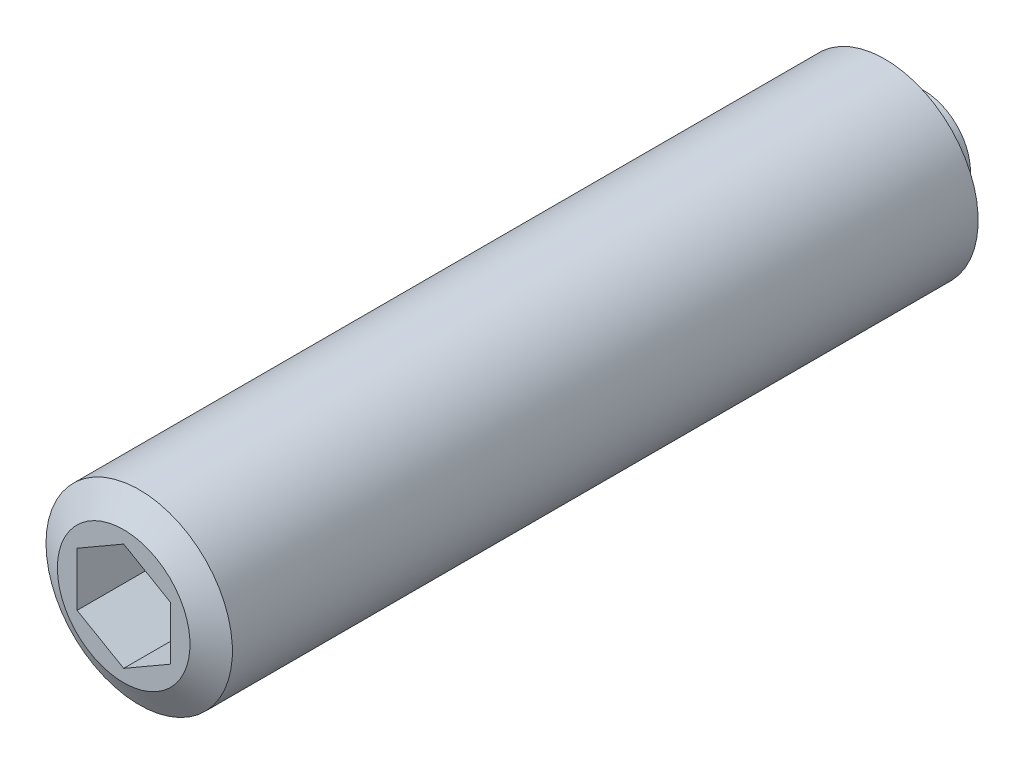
ISO-10303-21;
HEADER;
FILE_DESCRIPTION(('STEP AP214'),'2;1');
FILE_NAME('part.step','',(''),(''),'','','');
FILE_SCHEMA(('AUTOMOTIVE_DESIGN { 1 0 10303 214 1 1 1 1 }'));
ENDSEC;
DATA;
#1=APPLICATION_CONTEXT('core data for automotive mechanical design processes');
#2=APPLICATION_PROTOCOL_DEFINITION('international standard','automotive_design',2000,#1);
#3=PRODUCT_CONTEXT('',#1,'mechanical');
#4=PRODUCT('Part','Part','',(#3));
#5=PRODUCT_RELATED_PRODUCT_CATEGORY('part','',(#4));
#6=PRODUCT_DEFINITION_FORMATION('','',#4);
#7=PRODUCT_DEFINITION_CONTEXT('part definition',#1,'design');
#8=PRODUCT_DEFINITION('design','',#6,#7);
#9=PRODUCT_DEFINITION_SHAPE('','',#8);
#10=(LENGTH_UNIT() NAMED_UNIT(*) SI_UNIT(.MILLI.,.METRE.));
#11=(NAMED_UNIT(*) PLANE_ANGLE_UNIT() SI_UNIT($,.RADIAN.));
#12=(NAMED_UNIT(*) SI_UNIT($,.STERADIAN.) SOLID_ANGLE_UNIT());
#13=UNCERTAINTY_MEASURE_WITH_UNIT(LENGTH_MEASURE(1.E-05),#10,'distance_accuracy_value','');
#14=(GEOMETRIC_REPRESENTATION_CONTEXT(3) GLOBAL_UNCERTAINTY_ASSIGNED_CONTEXT((#13)) GLOBAL_UNIT_ASSIGNED_CONTEXT((#10,
#11,#12)) REPRESENTATION_CONTEXT('',''));
#15=CARTESIAN_POINT('',(0.,0.,0.));
#16=DIRECTION('',(0.,0.,1.));
#17=DIRECTION('',(1.,0.,0.));
#18=AXIS2_PLACEMENT_3D('',#15,#16,#17);
#19=CARTESIAN_POINT('',(0.,0.,0.));
#20=DIRECTION('',(0.,0.,-1.));
#21=DIRECTION('',(-1.,0.,0.));
#22=AXIS2_PLACEMENT_3D('',#19,#20,#21);
#23=PLANE('',#22);
#24=CARTESIAN_POINT('',(0.,0.,0.));
#25=DIRECTION('',(0.,0.,-1.));
#26=DIRECTION('',(-1.,0.,0.));
#27=AXIS2_PLACEMENT_3D('',#24,#25,#26);
#28=CIRCLE('',#27,3.);
#29=CARTESIAN_POINT('',(-3.,0.,0.));
#30=VERTEX_POINT('',#29);
#31=EDGE_CURVE('E9',#30,#30,#28,.T.);
#32=ORIENTED_EDGE('',*,*,#31,.T.);
#33=EDGE_LOOP('',(#32));
#34=FACE_BOUND('',#33,.T.);
#35=ADVANCED_FACE('F14',(#34),#23,.T.);
#36=CARTESIAN_POINT('',(0.,0.,-2.));
#37=DIRECTION('',(0.,0.,-1.));
#38=DIRECTION('',(-1.,0.,0.));
#39=AXIS2_PLACEMENT_3D('',#36,#37,#38);
#40=CYLINDRICAL_SURFACE('',#39,3.);
#41=CARTESIAN_POINT('',(0.,0.,1.5));
#42=DIRECTION('',(0.,0.,-1.));
#43=DIRECTION('',(-1.,0.,0.));
#44=AXIS2_PLACEMENT_3D('',#41,#42,#43);
#45=CIRCLE('',#44,3.);
#46=CARTESIAN_POINT('',(-3.,0.,1.5));
#47=VERTEX_POINT('',#46);
#48=EDGE_CURVE('E21',#47,#47,#45,.T.);
#49=ORIENTED_EDGE('',*,*,#48,.T.);
#50=EDGE_LOOP('',(#49));
#51=FACE_BOUND('',#50,.T.);
#52=ORIENTED_EDGE('',*,*,#31,.F.);
#53=EDGE_LOOP('',(#52));
#54=FACE_BOUND('',#53,.T.);
#55=ADVANCED_FACE('F134',(#51,#54),#40,.T.);
#56=CARTESIAN_POINT('',(0.,3.,1.5));
#57=DIRECTION('',(0.,0.,-1.));
#58=DIRECTION('',(-1.,0.,0.));
#59=AXIS2_PLACEMENT_3D('',#56,#57,#58);
#60=PLANE('',#59);
#61=CARTESIAN_POINT('',(0.,0.,1.5));
#62=DIRECTION('',(0.,0.,-1.));
#63=DIRECTION('',(-1.,0.,0.));
#64=AXIS2_PLACEMENT_3D('',#61,#62,#63);
#65=CIRCLE('',#64,4.267949);
#66=CARTESIAN_POINT('',(-4.267949,0.,1.5));
#67=VERTEX_POINT('',#66);
#68=EDGE_CURVE('E129',#67,#67,#65,.T.);
#69=ORIENTED_EDGE('',*,*,#68,.T.);
#70=EDGE_LOOP('',(#69));
#71=FACE_BOUND('',#70,.T.);
#72=ORIENTED_EDGE('',*,*,#48,.F.);
#73=EDGE_LOOP('',(#72));
#74=FACE_BOUND('',#73,.T.);
#75=ADVANCED_FACE('F137',(#71,#74),#60,.T.);
#76=CARTESIAN_POINT('',(0.,0.,1.5));
#77=DIRECTION('',(0.,0.,1.));
#78=DIRECTION('',(1.,0.,0.));
#79=AXIS2_PLACEMENT_3D('',#76,#77,#78);
#80=CONICAL_SURFACE('',#79,4.267949,1.04719759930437);
#81=CARTESIAN_POINT('',(0.,0.,2.5));
#82=DIRECTION('',(0.,0.,-1.));
#83=DIRECTION('',(-1.,0.,0.));
#84=AXIS2_PLACEMENT_3D('',#81,#82,#83);
#85=CIRCLE('',#84,6.);
#86=CARTESIAN_POINT('',(-6.,0.,2.5));
#87=VERTEX_POINT('',#86);
#88=EDGE_CURVE('E126',#87,#87,#85,.T.);
#89=ORIENTED_EDGE('',*,*,#88,.T.);
#90=EDGE_LOOP('',(#89));
#91=FACE_BOUND('',#90,.T.);
#92=ORIENTED_EDGE('',*,*,#68,.F.);
#93=EDGE_LOOP('',(#92));
#94=FACE_BOUND('',#93,.T.);
#95=ADVANCED_FACE('F139',(#91,#94),#80,.T.);
#96=CARTESIAN_POINT('',(0.,0.,-2.));
#97=DIRECTION('',(0.,0.,-1.));
#98=DIRECTION('',(-1.,0.,0.));
#99=AXIS2_PLACEMENT_3D('',#96,#97,#98);
#100=CYLINDRICAL_SURFACE('',#99,6.);
#101=CARTESIAN_POINT('',(0.,0.,50.5));
#102=DIRECTION('',(0.,0.,-1.));
#103=DIRECTION('',(-1.,0.,0.));
#104=AXIS2_PLACEMENT_3D('',#101,#102,#103);
#105=CIRCLE('',#104,6.);
#106=CARTESIAN_POINT('',(-6.,0.,50.5));
#107=VERTEX_POINT('',#106);
#108=EDGE_CURVE('E123',#107,#107,#105,.T.);
#109=ORIENTED_EDGE('',*,*,#108,.T.);
#110=EDGE_LOOP('',(#109));
#111=FACE_BOUND('',#110,.T.);
#112=ORIENTED_EDGE('',*,*,#88,.F.);
#113=EDGE_LOOP('',(#112));
#114=FACE_BOUND('',#113,.T.);
#115=ADVANCED_FACE('F148',(#111,#114),#100,.T.);
#116=CARTESIAN_POINT('',(0.,0.,50.5));
#117=DIRECTION('',(0.,0.,-1.));
#118=DIRECTION('',(-1.,0.,0.));
#119=AXIS2_PLACEMENT_3D('',#116,#117,#118);
#120=CONICAL_SURFACE('',#119,6.,1.04719759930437);
#121=CARTESIAN_POINT('',(0.,0.,51.5));
#122=DIRECTION('',(0.,0.,-1.));
#123=DIRECTION('',(-1.,0.,0.));
#124=AXIS2_PLACEMENT_3D('',#121,#122,#123);
#125=CIRCLE('',#124,4.267949);
#126=CARTESIAN_POINT('',(-4.267949,0.,51.5));
#127=VERTEX_POINT('',#126);
#128=EDGE_CURVE('E115',#127,#127,#125,.T.);
#129=ORIENTED_EDGE('',*,*,#128,.T.);
#130=EDGE_LOOP('',(#129));
#131=FACE_BOUND('',#130,.T.);
#132=ORIENTED_EDGE('',*,*,#108,.F.);
#133=EDGE_LOOP('',(#132));
#134=FACE_BOUND('',#133,.T.);
#135=ADVANCED_FACE('F187',(#131,#134),#120,.T.);
#136=CARTESIAN_POINT('',(0.,0.,51.5));
#137=DIRECTION('',(0.,0.,1.));
#138=DIRECTION('',(1.,0.,0.));
#139=AXIS2_PLACEMENT_3D('',#136,#137,#138);
#140=PLANE('',#139);
#141=DIRECTION('',(-0.866025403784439,0.5,0.));
#142=VECTOR('',#141,1.);
#143=CARTESIAN_POINT('',(3.,1.73205080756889,51.5));
#144=LINE('',#143,#142);
#145=CARTESIAN_POINT('',(3.,1.73205080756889,51.5));
#146=VERTEX_POINT('',#145);
#147=CARTESIAN_POINT('',(0.,3.46410161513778,51.5));
#148=VERTEX_POINT('',#147);
#149=EDGE_CURVE('E28',#146,#148,#144,.T.);
#150=ORIENTED_EDGE('',*,*,#149,.F.);
#151=DIRECTION('',(0.,1.,0.));
#152=VECTOR('',#151,1.);
#153=CARTESIAN_POINT('',(3.,-1.73205080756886,51.5));
#154=LINE('',#153,#152);
#155=CARTESIAN_POINT('',(3.,-1.73205080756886,51.5));
#156=VERTEX_POINT('',#155);
#157=EDGE_CURVE('E111',#156,#146,#154,.T.);
#158=ORIENTED_EDGE('',*,*,#157,.F.);
#159=DIRECTION('',(0.866025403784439,0.5,0.));
#160=VECTOR('',#159,1.);
#161=CARTESIAN_POINT('',(0.,-3.46410161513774,51.5));
#162=LINE('',#161,#160);
#163=CARTESIAN_POINT('',(0.,-3.46410161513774,51.5));
#164=VERTEX_POINT('',#163);
#165=EDGE_CURVE('E109',#164,#156,#162,.T.);
#166=ORIENTED_EDGE('',*,*,#165,.F.);
#167=DIRECTION('',(0.866025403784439,-0.5,0.));
#168=VECTOR('',#167,1.);
#169=CARTESIAN_POINT('',(-3.,-1.73205080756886,51.5));
#170=LINE('',#169,#168);
#171=CARTESIAN_POINT('',(-3.,-1.73205080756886,51.5));
#172=VERTEX_POINT('',#171);
#173=EDGE_CURVE('E76',#172,#164,#170,.T.);
#174=ORIENTED_EDGE('',*,*,#173,.F.);
#175=DIRECTION('',(0.,-1.,0.));
#176=VECTOR('',#175,1.);
#177=CARTESIAN_POINT('',(-3.,1.73205080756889,51.5));
#178=LINE('',#177,#176);
#179=CARTESIAN_POINT('',(-3.,1.73205080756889,51.5));
#180=VERTEX_POINT('',#179);
#181=EDGE_CURVE('E105',#180,#172,#178,.T.);
#182=ORIENTED_EDGE('',*,*,#181,.F.);
#183=DIRECTION('',(-0.866025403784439,-0.5,0.));
#184=VECTOR('',#183,1.);
#185=CARTESIAN_POINT('',(0.,3.46410161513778,51.5));
#186=LINE('',#185,#184);
#187=EDGE_CURVE('E102',#148,#180,#186,.T.);
#188=ORIENTED_EDGE('',*,*,#187,.F.);
#189=EDGE_LOOP('',(#150,#158,#166,#174,#182,#188));
#190=FACE_BOUND('',#189,.T.);
#191=ORIENTED_EDGE('',*,*,#128,.F.);
#192=EDGE_LOOP('',(#191));
#193=FACE_BOUND('',#192,.T.);
#194=ADVANCED_FACE('F195',(#190,#193),#140,.T.);
#195=CARTESIAN_POINT('',(3.,1.73205080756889,46.5));
#196=DIRECTION('',(0.5,0.866025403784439,0.));
#197=DIRECTION('',(-0.866025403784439,0.5,0.));
#198=AXIS2_PLACEMENT_3D('',#195,#196,#197);
#199=PLANE('',#198);
#200=ORIENTED_EDGE('',*,*,#149,.T.);
#201=DIRECTION('',(0.,0.,1.));
#202=VECTOR('',#201,1.);
#203=CARTESIAN_POINT('',(0.,3.46410161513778,46.5));
#204=LINE('',#203,#202);
#205=CARTESIAN_POINT('',(0.,3.46410161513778,46.5));
#206=VERTEX_POINT('',#205);
#207=EDGE_CURVE('E58',#206,#148,#204,.T.);
#208=ORIENTED_EDGE('',*,*,#207,.F.);
#209=DIRECTION('',(-0.866025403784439,0.5,0.));
#210=VECTOR('',#209,1.);
#211=CARTESIAN_POINT('',(3.,1.73205080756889,46.5));
#212=LINE('',#211,#210);
#213=CARTESIAN_POINT('',(3.,1.73205080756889,46.5));
#214=VERTEX_POINT('',#213);
#215=EDGE_CURVE('E113',#214,#206,#212,.T.);
#216=ORIENTED_EDGE('',*,*,#215,.F.);
#217=DIRECTION('',(0.,0.,1.));
#218=VECTOR('',#217,1.);
#219=CARTESIAN_POINT('',(3.,1.73205080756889,46.5));
#220=LINE('',#219,#218);
#221=EDGE_CURVE('E36',#214,#146,#220,.T.);
#222=ORIENTED_EDGE('',*,*,#221,.T.);
#223=EDGE_LOOP('',(#200,#208,#216,#222));
#224=FACE_BOUND('',#223,.T.);
#225=ADVANCED_FACE('F204',(#224),#199,.F.);
#226=CARTESIAN_POINT('',(3.,-1.73205080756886,46.5));
#227=DIRECTION('',(1.,0.,0.));
#228=DIRECTION('',(0.,0.,-1.));
#229=AXIS2_PLACEMENT_3D('',#226,#227,#228);
#230=PLANE('',#229);
#231=ORIENTED_EDGE('',*,*,#157,.T.);
#232=ORIENTED_EDGE('',*,*,#221,.F.);
#233=DIRECTION('',(0.,1.,0.));
#234=VECTOR('',#233,1.);
#235=CARTESIAN_POINT('',(3.,-1.73205080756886,46.5));
#236=LINE('',#235,#234);
#237=CARTESIAN_POINT('',(3.,-1.73205080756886,46.5));
#238=VERTEX_POINT('',#237);
#239=EDGE_CURVE('E88',#238,#214,#236,.T.);
#240=ORIENTED_EDGE('',*,*,#239,.F.);
#241=DIRECTION('',(0.,0.,1.));
#242=VECTOR('',#241,1.);
#243=CARTESIAN_POINT('',(3.,-1.73205080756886,46.5));
#244=LINE('',#243,#242);
#245=EDGE_CURVE('E80',#238,#156,#244,.T.);
#246=ORIENTED_EDGE('',*,*,#245,.T.);
#247=EDGE_LOOP('',(#231,#232,#240,#246));
#248=FACE_BOUND('',#247,.T.);
#249=ADVANCED_FACE('F213',(#248),#230,.F.);
#250=CARTESIAN_POINT('',(0.,-3.46410161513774,46.5));
#251=DIRECTION('',(0.5,-0.866025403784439,0.));
#252=DIRECTION('',(0.866025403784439,0.5,0.));
#253=AXIS2_PLACEMENT_3D('',#250,#251,#252);
#254=PLANE('',#253);
#255=ORIENTED_EDGE('',*,*,#165,.T.);
#256=ORIENTED_EDGE('',*,*,#245,.F.);
#257=DIRECTION('',(0.866025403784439,0.5,0.));
#258=VECTOR('',#257,1.);
#259=CARTESIAN_POINT('',(0.,-3.46410161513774,46.5));
#260=LINE('',#259,#258);
#261=CARTESIAN_POINT('',(0.,-3.46410161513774,46.5));
#262=VERTEX_POINT('',#261);
#263=EDGE_CURVE('E84',#262,#238,#260,.T.);
#264=ORIENTED_EDGE('',*,*,#263,.F.);
#265=DIRECTION('',(0.,0.,1.));
#266=VECTOR('',#265,1.);
#267=CARTESIAN_POINT('',(0.,-3.46410161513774,46.5));
#268=LINE('',#267,#266);
#269=EDGE_CURVE('E69',#262,#164,#268,.T.);
#270=ORIENTED_EDGE('',*,*,#269,.T.);
#271=EDGE_LOOP('',(#255,#256,#264,#270));
#272=FACE_BOUND('',#271,.T.);
#273=ADVANCED_FACE('F85',(#272),#254,.F.);
#274=CARTESIAN_POINT('',(-3.,-1.73205080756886,46.5));
#275=DIRECTION('',(-0.5,-0.866025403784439,0.));
#276=DIRECTION('',(0.866025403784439,-0.5,0.));
#277=AXIS2_PLACEMENT_3D('',#274,#275,#276);
#278=PLANE('',#277);
#279=ORIENTED_EDGE('',*,*,#173,.T.);
#280=ORIENTED_EDGE('',*,*,#269,.F.);
#281=DIRECTION('',(0.866025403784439,-0.5,0.));
#282=VECTOR('',#281,1.);
#283=CARTESIAN_POINT('',(-3.,-1.73205080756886,46.5));
#284=LINE('',#283,#282);
#285=CARTESIAN_POINT('',(-3.,-1.73205080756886,46.5));
#286=VERTEX_POINT('',#285);
#287=EDGE_CURVE('E73',#286,#262,#284,.T.);
#288=ORIENTED_EDGE('',*,*,#287,.F.);
#289=DIRECTION('',(0.,0.,1.));
#290=VECTOR('',#289,1.);
#291=CARTESIAN_POINT('',(-3.,-1.73205080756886,46.5));
#292=LINE('',#291,#290);
#293=EDGE_CURVE('E81',#286,#172,#292,.T.);
#294=ORIENTED_EDGE('',*,*,#293,.T.);
#295=EDGE_LOOP('',(#279,#280,#288,#294));
#296=FACE_BOUND('',#295,.T.);
#297=ADVANCED_FACE('F71',(#296),#278,.F.);
#298=CARTESIAN_POINT('',(-3.,1.73205080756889,46.5));
#299=DIRECTION('',(-1.,0.,0.));
#300=DIRECTION('',(0.,0.,1.));
#301=AXIS2_PLACEMENT_3D('',#298,#299,#300);
#302=PLANE('',#301);
#303=ORIENTED_EDGE('',*,*,#181,.T.);
#304=ORIENTED_EDGE('',*,*,#293,.F.);
#305=DIRECTION('',(0.,-1.,0.));
#306=VECTOR('',#305,1.);
#307=CARTESIAN_POINT('',(-3.,1.73205080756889,46.5));
#308=LINE('',#307,#306);
#309=CARTESIAN_POINT('',(-3.,1.73205080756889,46.5));
#310=VERTEX_POINT('',#309);
#311=EDGE_CURVE('E94',#310,#286,#308,.T.);
#312=ORIENTED_EDGE('',*,*,#311,.F.);
#313=DIRECTION('',(0.,0.,1.));
#314=VECTOR('',#313,1.);
#315=CARTESIAN_POINT('',(-3.,1.73205080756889,46.5));
#316=LINE('',#315,#314);
#317=EDGE_CURVE('E118',#310,#180,#316,.T.);
#318=ORIENTED_EDGE('',*,*,#317,.T.);
#319=EDGE_LOOP('',(#303,#304,#312,#318));
#320=FACE_BOUND('',#319,.T.);
#321=ADVANCED_FACE('F235',(#320),#302,.F.);
#322=CARTESIAN_POINT('',(0.,3.46410161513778,46.5));
#323=DIRECTION('',(-0.5,0.866025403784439,0.));
#324=DIRECTION('',(-0.866025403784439,-0.5,0.));
#325=AXIS2_PLACEMENT_3D('',#322,#323,#324);
#326=PLANE('',#325);
#327=ORIENTED_EDGE('',*,*,#187,.T.);
#328=ORIENTED_EDGE('',*,*,#317,.F.);
#329=DIRECTION('',(-0.866025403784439,-0.5,0.));
#330=VECTOR('',#329,1.);
#331=CARTESIAN_POINT('',(0.,3.46410161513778,46.5));
#332=LINE('',#331,#330);
#333=EDGE_CURVE('E96',#206,#310,#332,.T.);
#334=ORIENTED_EDGE('',*,*,#333,.F.);
#335=ORIENTED_EDGE('',*,*,#207,.T.);
#336=EDGE_LOOP('',(#327,#328,#334,#335));
#337=FACE_BOUND('',#336,.T.);
#338=ADVANCED_FACE('F243',(#337),#326,.F.);
#339=CARTESIAN_POINT('',(0.,3.46410161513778,46.5));
#340=DIRECTION('',(0.,0.,1.));
#341=DIRECTION('',(1.,0.,0.));
#342=AXIS2_PLACEMENT_3D('',#339,#340,#341);
#343=PLANE('',#342);
#344=ORIENTED_EDGE('',*,*,#215,.T.);
#345=ORIENTED_EDGE('',*,*,#333,.T.);
#346=ORIENTED_EDGE('',*,*,#311,.T.);
#347=ORIENTED_EDGE('',*,*,#287,.T.);
#348=ORIENTED_EDGE('',*,*,#263,.T.);
#349=ORIENTED_EDGE('',*,*,#239,.T.);
#350=EDGE_LOOP('',(#344,#345,#346,#347,#348,#349));
#351=FACE_BOUND('',#350,.T.);
#352=ADVANCED_FACE('F91',(#351),#343,.T.);
#353=CLOSED_SHELL('',(#35,#55,#75,#95,#115,#135,#194,#225,#249,#273,#297,#321,#338,#352));
#354=MANIFOLD_SOLID_BREP('B1',#353);
#355=ADVANCED_BREP_SHAPE_REPRESENTATION('',(#18,#354),#14);
#356=SHAPE_DEFINITION_REPRESENTATION(#9,#355);
ENDSEC;
END-ISO-10303-21;
